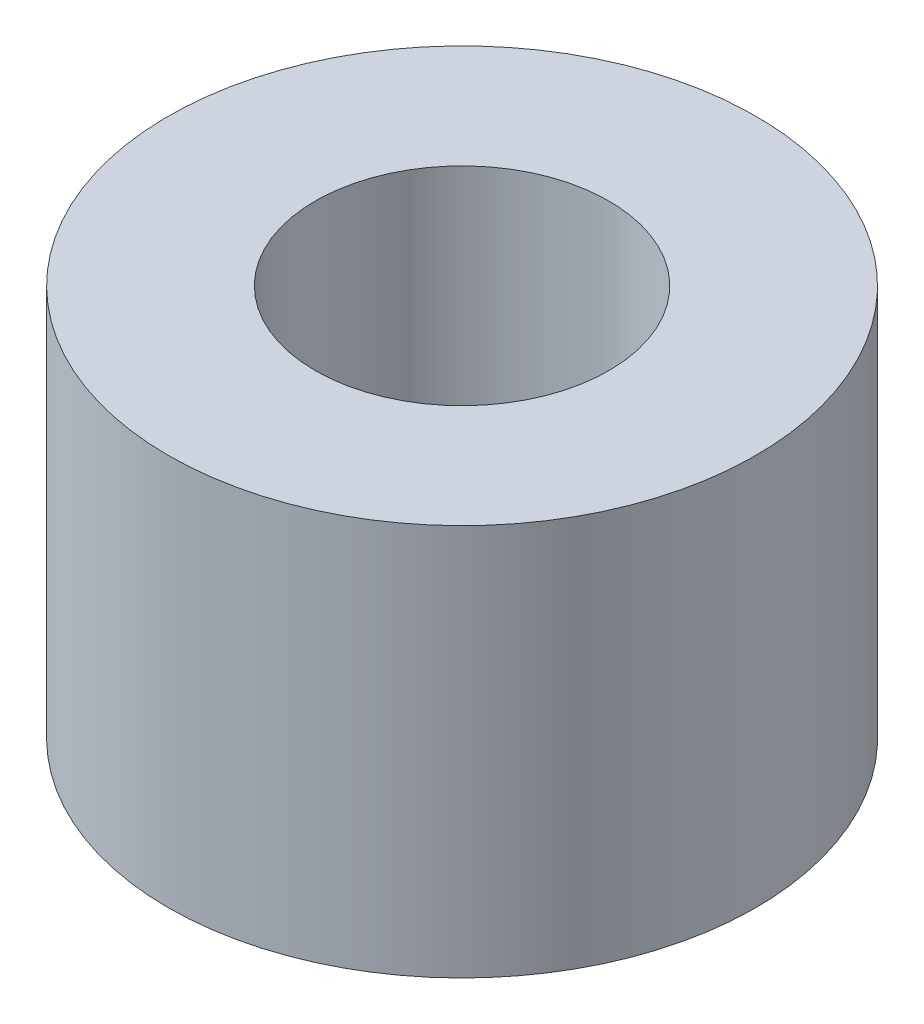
from build123d import *

# Parameters (mm, degrees)
SKETCH_3_R      = 3
SKETCH_3_R_2    = 1.5
EXTRUDE_2_DEPTH = 4


with BuildPart() as part:
    # Sketch 3 → Extrude 2 (new body)
    with BuildSketch(Plane(origin=(0, 0, 0), x_dir=(1, 0, 0), z_dir=(0, 1, 0))):
        with Locations(Location((0, 0, 0), (0, 0, 270))):
            Circle(SKETCH_3_R)
        with Locations(Location((0, 0, 0), (0, 0, 270))):
            Circle(SKETCH_3_R_2, mode=Mode.SUBTRACT)
    extrude(amount=EXTRUDE_2_DEPTH)


solid = part.part
